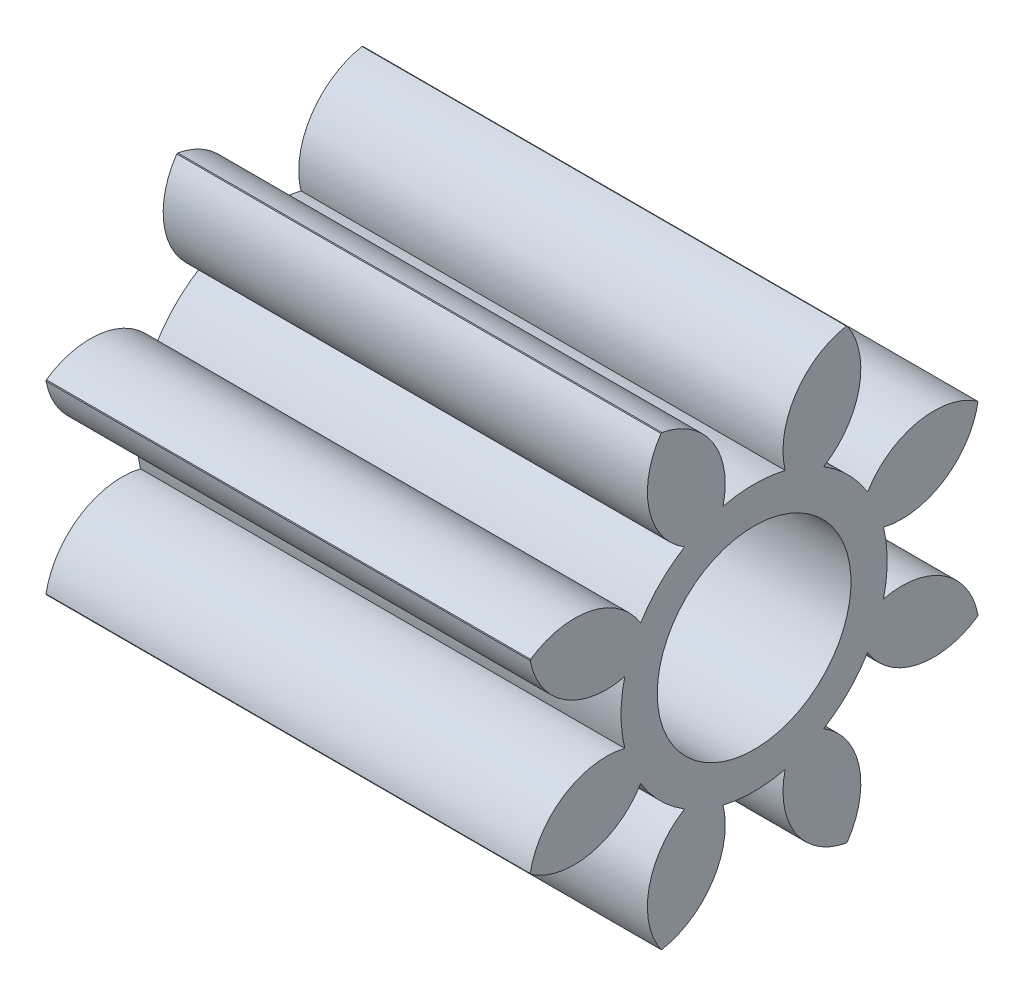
from build123d import *

# Parameters (mm, degrees)
BASPROSKE_W     = 5
BASPROSKE_H     = 2.5
TOOTHCUT_DEPTH  = 7.123724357
TEETHCUTS_COUNT = 8
BORSKE_R        = 1
BORE_DEPTH      = 50.0000508


with BuildPart() as part:
    # BasProSke → Base-Revolve (revolve)
    with BuildSketch(Plane(origin=(0, 0, 0), x_dir=(1, 0, 0), z_dir=(0, 1, 0)), mode=Mode.PRIVATE) as base_revolve_sk:
        with Locations((2.5, 1.25)):
            Rectangle(BASPROSKE_W, BASPROSKE_H)
    revolve(base_revolve_sk.sketch.rotate(Axis((-10, 0, 0), (1, 0, 0)), 180), axis=Axis((-10, 0, 0), (1, 0, 0)))

    # TooCutSke → ToothCut (cut, through all)
    with BuildSketch(Plane(origin=(0, 0, 0), x_dir=(0, 0, -1), z_dir=(1, 0, 0))):
        with BuildLine():
            ThreePointArc((0.32088842, 1.336003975), (0, 1.374), (-0.32088842, 1.336003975))
            ThreePointArc((-0.32088842, 1.336003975), (-0.439941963, 1.979751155), (-0.999814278, 2.319055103))
            ThreePointArc((-0.999814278, 2.319055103), (0, 2.5254), (0.999814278, 2.319055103))
            ThreePointArc((0.999814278, 2.319055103), (0.439941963, 1.979751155), (0.32088842, 1.336003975))
        make_face()
    toothcut = extrude(amount=TOOTHCUT_DEPTH, mode=Mode.SUBTRACT)

    # TeethCuts: ToothCut ×8 about axis
    teethcuts_axis = Axis((0, 0, 0), (1, 0, 0))
    for i in range(1, TEETHCUTS_COUNT):
        add(toothcut.rotate(teethcuts_axis, i * 360 / TEETHCUTS_COUNT), mode=Mode.SUBTRACT)

    # BorSke → Bore (cut, symmetric)
    with BuildSketch(Plane(origin=(0, 0, 0), x_dir=(0, 0, -1), z_dir=(1, 0, 0))):
        with Locations(Location((0, 0, 0), (0, 0, 180))):
            Circle(BORSKE_R)
    extrude(amount=BORE_DEPTH, both=True, mode=Mode.SUBTRACT)


solid = part.part
